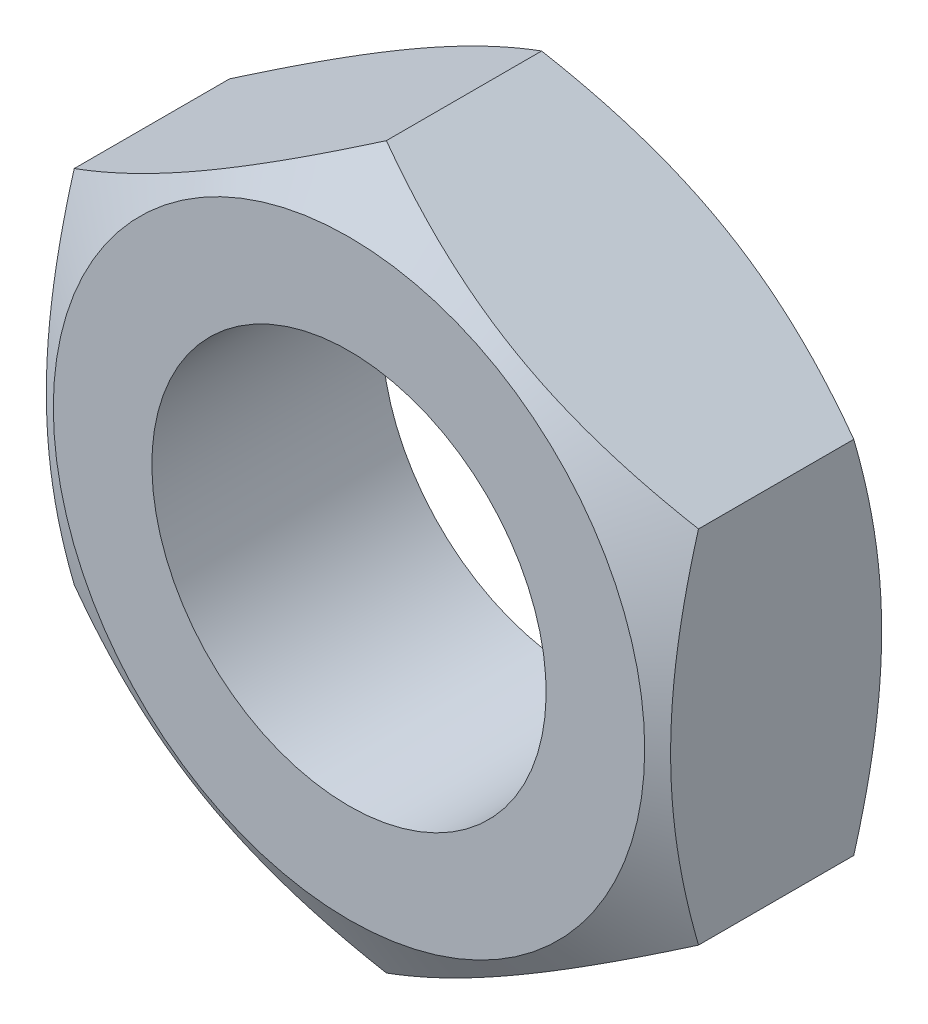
ISO-10303-21;
HEADER;
FILE_DESCRIPTION(('STEP AP214'),'2;1');
FILE_NAME('part.step','',(''),(''),'','','');
FILE_SCHEMA(('AUTOMOTIVE_DESIGN { 1 0 10303 214 1 1 1 1 }'));
ENDSEC;
DATA;
#1=APPLICATION_CONTEXT('core data for automotive mechanical design processes');
#2=APPLICATION_PROTOCOL_DEFINITION('international standard','automotive_design',2000,#1);
#3=PRODUCT_CONTEXT('',#1,'mechanical');
#4=PRODUCT('Part','Part','',(#3));
#5=PRODUCT_RELATED_PRODUCT_CATEGORY('part','',(#4));
#6=PRODUCT_DEFINITION_FORMATION('','',#4);
#7=PRODUCT_DEFINITION_CONTEXT('part definition',#1,'design');
#8=PRODUCT_DEFINITION('design','',#6,#7);
#9=PRODUCT_DEFINITION_SHAPE('','',#8);
#10=(LENGTH_UNIT() NAMED_UNIT(*) SI_UNIT(.MILLI.,.METRE.));
#11=(NAMED_UNIT(*) PLANE_ANGLE_UNIT() SI_UNIT($,.RADIAN.));
#12=(NAMED_UNIT(*) SI_UNIT($,.STERADIAN.) SOLID_ANGLE_UNIT());
#13=UNCERTAINTY_MEASURE_WITH_UNIT(LENGTH_MEASURE(1.E-05),#10,'distance_accuracy_value','');
#14=(GEOMETRIC_REPRESENTATION_CONTEXT(3) GLOBAL_UNCERTAINTY_ASSIGNED_CONTEXT((#13)) GLOBAL_UNIT_ASSIGNED_CONTEXT((#10,
#11,#12)) REPRESENTATION_CONTEXT('',''));
#15=CARTESIAN_POINT('',(0.,0.,0.));
#16=DIRECTION('',(0.,0.,1.));
#17=DIRECTION('',(1.,0.,0.));
#18=AXIS2_PLACEMENT_3D('',#15,#16,#17);
#19=CARTESIAN_POINT('',(-9.5,-5.48482755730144,10.));
#20=DIRECTION('',(-1.,0.,0.));
#21=DIRECTION('',(0.,0.,1.));
#22=AXIS2_PLACEMENT_3D('',#19,#20,#21);
#23=PLANE('',#22);
#24=CARTESIAN_POINT('',(-9.5,-14.8236051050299,2.03102792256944));
#25=CARTESIAN_POINT('',(-9.5,-14.6157605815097,2.13205783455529));
#26=CARTESIAN_POINT('',(-9.5,-14.4076745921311,2.23259076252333));
#27=CARTESIAN_POINT('',(-9.5,-13.9909693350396,2.43255026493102));
#28=CARTESIAN_POINT('',(-9.5,-13.7823500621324,2.53197682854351));
#29=CARTESIAN_POINT('',(-9.5,-13.1555624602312,2.82845402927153));
#30=CARTESIAN_POINT('',(-9.5,-12.7365244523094,3.02367288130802));
#31=CARTESIAN_POINT('',(-9.5,-11.8934370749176,3.40909408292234));
#32=CARTESIAN_POINT('',(-9.5,-11.4693728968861,3.5992641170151));
#33=CARTESIAN_POINT('',(-9.5,-10.6179039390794,3.97194486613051));
#34=CARTESIAN_POINT('',(-9.5,-10.1904993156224,4.15445593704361));
#35=CARTESIAN_POINT('',(-9.5,-9.31754199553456,4.51563983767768));
#36=CARTESIAN_POINT('',(-9.5,-8.87185469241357,4.6939890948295));
#37=CARTESIAN_POINT('',(-9.5,-7.97530061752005,5.03740807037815));
#38=CARTESIAN_POINT('',(-9.5,-7.52443327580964,5.20247631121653));
#39=CARTESIAN_POINT('',(-9.5,-6.61761118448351,5.51506563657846));
#40=CARTESIAN_POINT('',(-9.5,-6.16166854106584,5.66262146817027));
#41=CARTESIAN_POINT('',(-9.5,-5.24325954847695,5.93551302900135));
#42=CARTESIAN_POINT('',(-9.5,-4.78079527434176,6.06085566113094));
#43=CARTESIAN_POINT('',(-9.5,-3.85158182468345,6.28268820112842));
#44=CARTESIAN_POINT('',(-9.5,-3.38487173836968,6.37933746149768));
#45=CARTESIAN_POINT('',(-9.5,-2.68048494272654,6.49865231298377));
#46=CARTESIAN_POINT('',(-9.5,-2.44495249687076,6.53414900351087));
#47=CARTESIAN_POINT('',(-9.5,-1.97268628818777,6.59589537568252));
#48=CARTESIAN_POINT('',(-9.5,-1.73595264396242,6.62214595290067));
#49=CARTESIAN_POINT('',(-9.5,-1.26473411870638,6.66454302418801));
#50=CARTESIAN_POINT('',(-9.5,-1.0302608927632,6.68081853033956));
#51=CARTESIAN_POINT('',(-9.5,-0.560836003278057,6.70343487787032));
#52=CARTESIAN_POINT('',(-9.5,-0.32588434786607,6.7097758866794));
#53=CARTESIAN_POINT('',(-9.5,0.144076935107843,6.71237165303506));
#54=CARTESIAN_POINT('',(-9.5,0.379086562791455,6.70862638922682));
#55=CARTESIAN_POINT('',(-9.5,0.848736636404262,6.6911423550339));
#56=CARTESIAN_POINT('',(-9.5,1.08337706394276,6.67740310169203));
#57=CARTESIAN_POINT('',(-9.5,1.64454129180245,6.63288654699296));
#58=CARTESIAN_POINT('',(-9.5,1.97070898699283,6.59752022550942));
#59=CARTESIAN_POINT('',(-9.5,2.62066766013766,6.50938491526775));
#60=CARTESIAN_POINT('',(-9.5,2.9444583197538,6.45661363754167));
#61=CARTESIAN_POINT('',(-9.5,3.9118684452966,6.27498681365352));
#62=CARTESIAN_POINT('',(-9.5,4.5511772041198,6.12284965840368));
#63=CARTESIAN_POINT('',(-9.5,5.50727203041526,5.85845268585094));
#64=CARTESIAN_POINT('',(-9.5,5.82900138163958,5.76303539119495));
#65=CARTESIAN_POINT('',(-9.5,6.46933644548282,5.56214641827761));
#66=CARTESIAN_POINT('',(-9.5,6.7879421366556,5.45667467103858));
#67=CARTESIAN_POINT('',(-9.5,7.42212775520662,5.23738106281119));
#68=CARTESIAN_POINT('',(-9.5,7.73770860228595,5.1235618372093));
#69=CARTESIAN_POINT('',(-9.5,8.3662454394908,4.88892687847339));
#70=CARTESIAN_POINT('',(-9.5,8.67920146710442,4.76811124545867));
#71=CARTESIAN_POINT('',(-9.5,9.44360575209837,4.46475692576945));
#72=CARTESIAN_POINT('',(-9.5,9.89376872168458,4.27898465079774));
#73=CARTESIAN_POINT('',(-9.5,10.7900480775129,3.89789258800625));
#74=CARTESIAN_POINT('',(-9.5,11.2361641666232,3.70257210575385));
#75=CARTESIAN_POINT('',(-9.5,12.1251476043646,3.30438557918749));
#76=CARTESIAN_POINT('',(-9.5,12.5680140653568,3.10151755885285));
#77=CARTESIAN_POINT('',(-9.5,13.4509517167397,2.68983228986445));
#78=CARTESIAN_POINT('',(-9.5,13.8910229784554,2.48101519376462));
#79=CARTESIAN_POINT('',(-9.5,14.7693971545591,2.05833284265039));
#80=CARTESIAN_POINT('',(-9.5,15.2076972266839,1.8444616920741));
#81=CARTESIAN_POINT('',(-9.5,16.0823702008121,1.41281441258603));
#82=CARTESIAN_POINT('',(-9.5,16.5187430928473,1.19503826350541));
#83=CARTESIAN_POINT('',(-9.5,17.3898045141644,0.756309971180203));
#84=CARTESIAN_POINT('',(-9.5,17.8244932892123,0.535358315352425));
#85=CARTESIAN_POINT('',(-9.5,18.6925046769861,0.0907861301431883));
#86=CARTESIAN_POINT('',(-9.5,19.1258272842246,-0.132834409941));
#87=CARTESIAN_POINT('',(-9.5,20.3465823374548,-0.766800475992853));
#88=CARTESIAN_POINT('',(-9.5,21.1326754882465,-1.17972473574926));
#89=CARTESIAN_POINT('',(-9.5,22.7019966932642,-2.01104787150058));
#90=CARTESIAN_POINT('',(-9.5,23.4852246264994,-2.42944697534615));
#91=CARTESIAN_POINT('',(-9.5,25.0473018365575,-3.26925527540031));
#92=CARTESIAN_POINT('',(-9.5,25.8261572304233,-3.69065310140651));
#93=CARTESIAN_POINT('',(-9.5,26.9931018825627,-4.32515233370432));
#94=CARTESIAN_POINT('',(-9.5,27.3818487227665,-4.53704610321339));
#95=CARTESIAN_POINT('',(-9.5,28.1589485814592,-4.96155326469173));
#96=CARTESIAN_POINT('',(-9.5,28.5473016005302,-5.17416665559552));
#97=CARTESIAN_POINT('',(-9.5,28.9354805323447,-5.38709750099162));
#98=B_SPLINE_CURVE_WITH_KNOTS('',3,(#24,#25,#26,#27,#28,#29,#30,#31,#32,#33,#34,#35,#36,#37,#38,
#39,#40,#41,#42,#43,#44,#45,#46,#47,#48,#49,#50,#51,#52,#53,#54,#55,#56,#57,#58,#59,#60,#61,#62,
#63,#64,#65,#66,#67,#68,#69,#70,#71,#72,#73,#74,#75,#76,#77,#78,#79,#80,#81,#82,#83,#84,#85,#86,
#87,#88,#89,#90,#91,#92,#93,#94,#95,#96,#97),.UNSPECIFIED.,.F.,.F.,(4,2,2,2,2,2,2,2,2,2,2,2,2,2,
2,2,2,2,2,2,2,2,2,2,2,2,2,2,2,2,2,2,2,2,2,2,4),(0.,0.693293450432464,1.38659367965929,
2.7733947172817,4.16759357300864,5.56172757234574,7.00170593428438,8.44184427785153,
9.87907564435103,11.3158595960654,12.7445081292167,13.458932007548,14.173286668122,
14.8781957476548,15.5830929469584,16.2879916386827,16.9929243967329,17.9766088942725,
18.9604228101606,20.929096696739,21.9357517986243,22.9424138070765,23.9487593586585,
24.9550905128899,26.4159040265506,27.8768239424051,29.3381290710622,30.7993967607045,
32.2624625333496,33.7255358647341,35.1883869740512,36.6512439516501,39.3150503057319,
41.9789678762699,44.6355956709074,45.963829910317,47.2920621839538),.UNSPECIFIED.);
#99=CARTESIAN_POINT('',(-9.5,5.48482755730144,5.8628190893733));
#100=VERTEX_POINT('',#99);
#101=CARTESIAN_POINT('',(-9.5,-5.48482755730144,5.8628190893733));
#102=VERTEX_POINT('',#101);
#103=EDGE_CURVE('E74',#100,#102,#98,.F.);
#104=ORIENTED_EDGE('',*,*,#103,.F.);
#105=DIRECTION('',(0.,0.,-1.));
#106=VECTOR('',#105,1.);
#107=CARTESIAN_POINT('',(-9.5,5.48482755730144,10.));
#108=LINE('',#107,#106);
#109=CARTESIAN_POINT('',(-9.5,5.48482755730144,1.1371809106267));
#110=VERTEX_POINT('',#109);
#111=EDGE_CURVE('E43',#100,#110,#108,.T.);
#112=ORIENTED_EDGE('',*,*,#111,.T.);
#113=CARTESIAN_POINT('',(-9.5,-14.6687006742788,4.8937894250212));
#114=CARTESIAN_POINT('',(-9.5,-14.4615084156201,4.79338645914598));
#115=CARTESIAN_POINT('',(-9.5,-14.2540712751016,4.69348906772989));
#116=CARTESIAN_POINT('',(-9.5,-13.8386561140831,4.4948200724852));
#117=CARTESIAN_POINT('',(-9.5,-13.63067808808,4.39604848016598));
#118=CARTESIAN_POINT('',(-9.5,-13.0057997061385,4.10156789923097));
#119=CARTESIAN_POINT('',(-9.5,-12.5880173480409,3.90772338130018));
#120=CARTESIAN_POINT('',(-9.5,-11.7473306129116,3.52513337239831));
#121=CARTESIAN_POINT('',(-9.5,-11.3244106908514,3.33642195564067));
#122=CARTESIAN_POINT('',(-9.5,-10.4751851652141,2.96680533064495));
#123=CARTESIAN_POINT('',(-9.5,-10.0488797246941,2.78589974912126));
#124=CARTESIAN_POINT('',(-9.5,-9.17870639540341,2.42841765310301));
#125=CARTESIAN_POINT('',(-9.5,-8.73470813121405,2.25215673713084));
#126=CARTESIAN_POINT('',(-9.5,-7.84149462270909,1.91313091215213));
#127=CARTESIAN_POINT('',(-9.5,-7.39227879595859,1.75036752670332));
#128=CARTESIAN_POINT('',(-9.5,-6.48877170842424,1.44265749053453));
#129=CARTESIAN_POINT('',(-9.5,-6.03449305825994,1.29767421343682));
#130=CARTESIAN_POINT('',(-9.5,-5.11943656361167,1.03021677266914));
#131=CARTESIAN_POINT('',(-9.5,-4.65866083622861,0.90773545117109));
#132=CARTESIAN_POINT('',(-9.5,-3.73280971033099,0.69185651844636));
#133=CARTESIAN_POINT('',(-9.5,-3.26777143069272,0.598304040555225));
#134=CARTESIAN_POINT('',(-9.5,-2.56603115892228,0.483755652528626));
#135=CARTESIAN_POINT('',(-9.5,-2.33140289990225,0.449868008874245));
#136=CARTESIAN_POINT('',(-9.5,-1.86100211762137,0.391352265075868));
#137=CARTESIAN_POINT('',(-9.5,-1.62522970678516,0.366723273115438));
#138=CARTESIAN_POINT('',(-9.5,-1.15590855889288,0.32752110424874));
#139=CARTESIAN_POINT('',(-9.5,-0.922370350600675,0.3128223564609));
#140=CARTESIAN_POINT('',(-9.5,-0.454881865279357,0.293309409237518));
#141=CARTESIAN_POINT('',(-9.5,-0.220931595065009,0.288495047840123));
#142=CARTESIAN_POINT('',(-9.5,0.24696380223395,0.288865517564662));
#143=CARTESIAN_POINT('',(-9.5,0.480908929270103,0.294050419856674));
#144=CARTESIAN_POINT('',(-9.5,0.948374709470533,0.314293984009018));
#145=CARTESIAN_POINT('',(-9.5,1.1818953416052,0.329353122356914));
#146=CARTESIAN_POINT('',(-9.5,1.74506682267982,0.377260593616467));
#147=CARTESIAN_POINT('',(-9.5,2.07431695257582,0.414902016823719));
#148=CARTESIAN_POINT('',(-9.5,2.73033314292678,0.507748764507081));
#149=CARTESIAN_POINT('',(-9.5,3.05709885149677,0.562956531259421));
#150=CARTESIAN_POINT('',(-9.5,3.70784821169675,0.688971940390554));
#151=CARTESIAN_POINT('',(-9.5,4.0318294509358,0.759791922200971));
#152=CARTESIAN_POINT('',(-9.5,4.6765223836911,0.914874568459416));
#153=CARTESIAN_POINT('',(-9.5,4.99723413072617,0.999137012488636));
#154=CARTESIAN_POINT('',(-9.5,5.64242354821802,1.18104499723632));
#155=CARTESIAN_POINT('',(-9.5,5.9668293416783,1.27894371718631));
#156=CARTESIAN_POINT('',(-9.5,6.61244437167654,1.48471494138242));
#157=CARTESIAN_POINT('',(-9.5,6.93365358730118,1.59258751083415));
#158=CARTESIAN_POINT('',(-9.5,7.57303689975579,1.81660597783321));
#159=CARTESIAN_POINT('',(-9.5,7.89121199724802,1.93274903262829));
#160=CARTESIAN_POINT('',(-9.5,8.52493489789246,2.17195591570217));
#161=CARTESIAN_POINT('',(-9.5,8.84048273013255,2.29501966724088));
#162=CARTESIAN_POINT('',(-9.5,9.57839301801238,2.59064158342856));
#163=CARTESIAN_POINT('',(-9.5,9.99981165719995,2.76555194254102));
#164=CARTESIAN_POINT('',(-9.5,10.8391313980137,3.12364137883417));
#165=CARTESIAN_POINT('',(-9.5,11.2570322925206,3.30682093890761));
#166=CARTESIAN_POINT('',(-9.5,12.0899638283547,3.67981000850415));
#167=CARTESIAN_POINT('',(-9.5,12.5049938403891,3.86962091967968));
#168=CARTESIAN_POINT('',(-9.5,13.3325690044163,4.25455026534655));
#169=CARTESIAN_POINT('',(-9.5,13.7451142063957,4.44966859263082));
#170=CARTESIAN_POINT('',(-9.5,14.5685623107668,4.84443708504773));
#171=CARTESIAN_POINT('',(-9.5,14.9794630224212,5.0440918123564));
#172=CARTESIAN_POINT('',(-9.5,15.7995097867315,5.44697126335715));
#173=CARTESIAN_POINT('',(-9.5,16.2086558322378,5.65019600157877));
#174=CARTESIAN_POINT('',(-9.5,17.4337773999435,6.26423545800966));
#175=CARTESIAN_POINT('',(-9.5,18.2475397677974,6.67946539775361));
#176=CARTESIAN_POINT('',(-9.5,19.8038422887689,7.48365456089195));
#177=CARTESIAN_POINT('',(-9.5,20.5467231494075,7.87195733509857));
#178=CARTESIAN_POINT('',(-9.5,22.0297276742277,8.65384922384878));
#179=CARTESIAN_POINT('',(-9.5,22.7698512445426,9.047438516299));
#180=CARTESIAN_POINT('',(-9.5,24.2461609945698,9.8376962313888));
#181=CARTESIAN_POINT('',(-9.5,24.9823523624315,10.2343549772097));
#182=CARTESIAN_POINT('',(-9.5,26.4529685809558,11.0308418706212));
#183=CARTESIAN_POINT('',(-9.5,27.187393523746,11.4306698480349));
#184=CARTESIAN_POINT('',(-9.5,27.9211664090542,11.8316829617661));
#185=B_SPLINE_CURVE_WITH_KNOTS('',3,(#113,#114,#115,#116,#117,#118,#119,#120,#121,#122,#123,
#124,#125,#126,#127,#128,#129,#130,#131,#132,#133,#134,#135,#136,#137,#138,#139,#140,#141,#142,
#143,#144,#145,#146,#147,#148,#149,#150,#151,#152,#153,#154,#155,#156,#157,#158,#159,#160,#161,
#162,#163,#164,#165,#166,#167,#168,#169,#170,#171,#172,#173,#174,#175,#176,#177,#178,#179,#180,
#181,#182,#183,#184),.UNSPECIFIED.,.F.,.F.,(4,2,2,2,2,2,2,2,2,2,2,2,2,2,2,2,2,2,2,2,2,2,2,2,2,2,
2,2,2,2,2,2,2,2,2,4),(0.,0.690711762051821,1.38143057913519,2.76307600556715,4.15235213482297,
5.54156175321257,6.97450756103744,8.40761489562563,9.83771864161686,11.2673666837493,
12.6892232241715,13.4002577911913,14.1112238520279,14.8130222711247,15.5148091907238,
16.2166011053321,16.9184268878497,17.9120601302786,18.9058315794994,19.9003913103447,
20.8949347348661,21.911310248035,22.9276924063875,23.9437268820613,24.9597500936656,
26.3284573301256,27.6972445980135,29.0663229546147,30.4353736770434,31.8058681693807,
33.1763682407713,35.9170238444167,38.4317295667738,40.9465201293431,43.455265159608,
45.9638763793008),.UNSPECIFIED.);
#186=CARTESIAN_POINT('',(-9.5,-5.48482755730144,1.13718091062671));
#187=VERTEX_POINT('',#186);
#188=EDGE_CURVE('E92',#187,#110,#185,.T.);
#189=ORIENTED_EDGE('',*,*,#188,.F.);
#190=DIRECTION('',(0.,0.,-1.));
#191=VECTOR('',#190,1.);
#192=CARTESIAN_POINT('',(-9.5,-5.48482755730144,10.));
#193=LINE('',#192,#191);
#194=EDGE_CURVE('E29',#102,#187,#193,.T.);
#195=ORIENTED_EDGE('',*,*,#194,.F.);
#196=EDGE_LOOP('',(#104,#112,#189,#195));
#197=FACE_BOUND('',#196,.T.);
#198=ADVANCED_FACE('F14',(#197),#23,.T.);
#199=CARTESIAN_POINT('',(-9.5,-5.48482755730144,10.));
#200=DIRECTION('',(0.5,0.86602540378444,0.));
#201=DIRECTION('',(-0.86602540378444,0.5,0.));
#202=AXIS2_PLACEMENT_3D('',#199,#200,#201);
#203=PLANE('',#202);
#204=DIRECTION('',(0.,0.,-1.));
#205=VECTOR('',#204,1.);
#206=CARTESIAN_POINT('',(0.,-10.9696551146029,10.));
#207=LINE('',#206,#205);
#208=CARTESIAN_POINT('',(0.,-10.9696551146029,5.86281908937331));
#209=VERTEX_POINT('',#208);
#210=CARTESIAN_POINT('',(0.,-10.9696551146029,1.1371809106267));
#211=VERTEX_POINT('',#210);
#212=EDGE_CURVE('E99',#209,#211,#207,.T.);
#213=ORIENTED_EDGE('',*,*,#212,.F.);
#214=CARTESIAN_POINT('',(0.000200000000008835,-10.9697705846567,5.86275242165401));
#215=CARTESIAN_POINT('',(-0.208630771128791,-10.8492020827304,5.93235142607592));
#216=CARTESIAN_POINT('',(-0.4182401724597,-10.7281840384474,5.99879155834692));
#217=CARTESIAN_POINT('',(-0.839139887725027,-10.4851774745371,6.12447758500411));
#218=CARTESIAN_POINT('',(-1.05043073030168,-10.3631886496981,6.18372111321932));
#219=CARTESIAN_POINT('',(-1.68770779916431,-9.99525656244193,6.34951029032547));
#220=CARTESIAN_POINT('',(-2.11620976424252,-9.74786083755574,6.4438104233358));
#221=CARTESIAN_POINT('',(-2.75744333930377,-9.37764446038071,6.55438616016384));
#222=CARTESIAN_POINT('',(-2.96825921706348,-9.25592985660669,6.58588503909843));
#223=CARTESIAN_POINT('',(-3.39086703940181,-9.01193711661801,6.63870666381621));
#224=CARTESIAN_POINT('',(-3.60265900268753,-8.8896589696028,6.66002921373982));
#225=CARTESIAN_POINT('',(-4.02659621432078,-8.64489870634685,6.69195184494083));
#226=CARTESIAN_POINT('',(-4.23874074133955,-8.52241700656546,6.70256466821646));
#227=CARTESIAN_POINT('',(-4.66322575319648,-8.2773404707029,6.71284233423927));
#228=CARTESIAN_POINT('',(-4.87556623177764,-8.15474563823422,6.71250751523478));
#229=CARTESIAN_POINT('',(-5.27254199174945,-7.92555157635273,6.70165149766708));
#230=CARTESIAN_POINT('',(-5.45720529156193,-7.81893617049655,6.69245459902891));
#231=CARTESIAN_POINT('',(-5.82610000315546,-7.6059547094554,6.66595946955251));
#232=CARTESIAN_POINT('',(-6.01033138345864,-7.49958867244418,6.64866066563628));
#233=CARTESIAN_POINT('',(-6.562311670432,-7.18090270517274,6.58502038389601));
#234=CARTESIAN_POINT('',(-6.92908353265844,-6.96914687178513,6.52694296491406));
#235=CARTESIAN_POINT('',(-7.66651782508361,-6.5433889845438,6.38174885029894));
#236=CARTESIAN_POINT('',(-8.03708614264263,-6.32944126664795,6.29401669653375));
#237=CARTESIAN_POINT('',(-8.77269671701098,-5.90473630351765,6.09490112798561));
#238=CARTESIAN_POINT('',(-9.137748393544,-5.69397361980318,5.98356447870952));
#239=CARTESIAN_POINT('',(-9.5002,-5.4847120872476,5.86275242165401));
#240=B_SPLINE_CURVE_WITH_KNOTS('',3,(#214,#215,#216,#217,#218,#219,#220,#221,#222,#223,#224,
#225,#226,#227,#228,#229,#230,#231,#232,#233,#234,#235,#236,#237,#238,#239),.UNSPECIFIED.,.F.,
.F.,(4,2,2,2,2,2,2,2,2,2,2,2,4),(0.,0.752880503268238,1.50600787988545,3.0154687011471,
3.75167336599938,4.48789219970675,5.22323407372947,5.95855322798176,6.59868084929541,
7.23885375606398,8.52010929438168,9.82978009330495,11.1368800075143),.UNSPECIFIED.);
#241=EDGE_CURVE('E80',#209,#102,#240,.T.);
#242=ORIENTED_EDGE('',*,*,#241,.T.);
#243=ORIENTED_EDGE('',*,*,#194,.T.);
#244=CARTESIAN_POINT('',(-9.5002,-5.4847120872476,1.13724757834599));
#245=CARTESIAN_POINT('',(-9.2913692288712,-5.60528058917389,1.06764857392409));
#246=CARTESIAN_POINT('',(-9.08175982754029,-5.72629863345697,1.00120844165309));
#247=CARTESIAN_POINT('',(-8.66086011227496,-5.96930519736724,0.875522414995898));
#248=CARTESIAN_POINT('',(-8.44956926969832,-6.09129402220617,0.816278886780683));
#249=CARTESIAN_POINT('',(-7.81229220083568,-6.45922610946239,0.650489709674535));
#250=CARTESIAN_POINT('',(-7.38379023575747,-6.70662183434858,0.556189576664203));
#251=CARTESIAN_POINT('',(-6.74255666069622,-7.07683821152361,0.44561383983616));
#252=CARTESIAN_POINT('',(-6.53174078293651,-7.19855281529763,0.414114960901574));
#253=CARTESIAN_POINT('',(-6.10913296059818,-7.44254555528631,0.361293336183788));
#254=CARTESIAN_POINT('',(-5.89734099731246,-7.56482370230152,0.33997078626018));
#255=CARTESIAN_POINT('',(-5.4734037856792,-7.80958396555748,0.308048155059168));
#256=CARTESIAN_POINT('',(-5.26125925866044,-7.93206566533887,0.297435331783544));
#257=CARTESIAN_POINT('',(-4.83677424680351,-8.17714220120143,0.287157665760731));
#258=CARTESIAN_POINT('',(-4.62443376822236,-8.29973703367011,0.287492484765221));
#259=CARTESIAN_POINT('',(-4.22745800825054,-8.5289310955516,0.298348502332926));
#260=CARTESIAN_POINT('',(-4.04279470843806,-8.63554650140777,0.30754540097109));
#261=CARTESIAN_POINT('',(-3.67389999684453,-8.84852796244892,0.334040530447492));
#262=CARTESIAN_POINT('',(-3.48966861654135,-8.95489399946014,0.35133933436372));
#263=CARTESIAN_POINT('',(-2.93768832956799,-9.27357996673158,0.414979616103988));
#264=CARTESIAN_POINT('',(-2.57091646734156,-9.48533580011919,0.473057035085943));
#265=CARTESIAN_POINT('',(-1.83348217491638,-9.91109368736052,0.618251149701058));
#266=CARTESIAN_POINT('',(-1.46291385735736,-10.1250414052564,0.705983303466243));
#267=CARTESIAN_POINT('',(-0.727303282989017,-10.5497463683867,0.905098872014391));
#268=CARTESIAN_POINT('',(-0.362251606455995,-10.7605090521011,1.01643552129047));
#269=CARTESIAN_POINT('',(0.00020000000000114,-10.9697705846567,1.13724757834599));
#270=B_SPLINE_CURVE_WITH_KNOTS('',3,(#244,#245,#246,#247,#248,#249,#250,#251,#252,#253,#254,
#255,#256,#257,#258,#259,#260,#261,#262,#263,#264,#265,#266,#267,#268,#269),.UNSPECIFIED.,.F.,
.F.,(4,2,2,2,2,2,2,2,2,2,2,2,4),(0.,0.752880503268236,1.50600787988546,3.01546870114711,
3.75167336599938,4.48789219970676,5.22323407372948,5.95855322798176,6.59868084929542,
7.23885375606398,8.52010929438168,9.82978009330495,11.1368800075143),.UNSPECIFIED.);
#271=EDGE_CURVE('E166',#187,#211,#270,.T.);
#272=ORIENTED_EDGE('',*,*,#271,.T.);
#273=EDGE_LOOP('',(#213,#242,#243,#272));
#274=FACE_BOUND('',#273,.T.);
#275=ADVANCED_FACE('F16',(#274),#203,.F.);
#276=CARTESIAN_POINT('',(9.5,-5.48482755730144,10.));
#277=DIRECTION('',(0.5,-0.86602540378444,0.));
#278=DIRECTION('',(0.86602540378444,0.5,0.));
#279=AXIS2_PLACEMENT_3D('',#276,#277,#278);
#280=PLANE('',#279);
#281=CARTESIAN_POINT('',(-0.000199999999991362,-10.9697705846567,5.86275242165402));
#282=CARTESIAN_POINT('',(0.208630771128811,-10.8492020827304,5.93235142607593));
#283=CARTESIAN_POINT('',(0.41824017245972,-10.7281840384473,5.99879155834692));
#284=CARTESIAN_POINT('',(0.839139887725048,-10.4851774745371,6.12447758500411));
#285=CARTESIAN_POINT('',(1.0504307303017,-10.3631886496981,6.18372111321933));
#286=CARTESIAN_POINT('',(1.68770779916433,-9.99525656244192,6.34951029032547));
#287=CARTESIAN_POINT('',(2.11620976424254,-9.74786083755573,6.4438104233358));
#288=CARTESIAN_POINT('',(2.75744333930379,-9.3776444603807,6.55438616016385));
#289=CARTESIAN_POINT('',(2.9682592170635,-9.25592985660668,6.58588503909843));
#290=CARTESIAN_POINT('',(3.39086703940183,-9.011937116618,6.63870666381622));
#291=CARTESIAN_POINT('',(3.60265900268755,-8.88965896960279,6.66002921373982));
#292=CARTESIAN_POINT('',(4.0265962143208,-8.64489870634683,6.69195184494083));
#293=CARTESIAN_POINT('',(4.23874074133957,-8.52241700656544,6.70256466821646));
#294=CARTESIAN_POINT('',(4.6632257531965,-8.27734047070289,6.71284233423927));
#295=CARTESIAN_POINT('',(4.87556623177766,-8.15474563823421,6.71250751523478));
#296=CARTESIAN_POINT('',(5.27254199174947,-7.92555157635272,6.70165149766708));
#297=CARTESIAN_POINT('',(5.45720529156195,-7.81893617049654,6.69245459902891));
#298=CARTESIAN_POINT('',(5.82610000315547,-7.60595470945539,6.66595946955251));
#299=CARTESIAN_POINT('',(6.01033138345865,-7.49958867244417,6.64866066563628));
#300=CARTESIAN_POINT('',(6.56231167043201,-7.18090270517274,6.58502038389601));
#301=CARTESIAN_POINT('',(6.92908353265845,-6.96914687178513,6.52694296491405));
#302=CARTESIAN_POINT('',(7.66651782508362,-6.54338898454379,6.38174885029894));
#303=CARTESIAN_POINT('',(8.03708614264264,-6.32944126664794,6.29401669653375));
#304=CARTESIAN_POINT('',(8.77269671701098,-5.90473630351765,6.0949011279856));
#305=CARTESIAN_POINT('',(9.13774839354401,-5.69397361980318,5.98356447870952));
#306=CARTESIAN_POINT('',(9.5002,-5.4847120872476,5.86275242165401));
#307=B_SPLINE_CURVE_WITH_KNOTS('',3,(#281,#282,#283,#284,#285,#286,#287,#288,#289,#290,#291,
#292,#293,#294,#295,#296,#297,#298,#299,#300,#301,#302,#303,#304,#305,#306),.UNSPECIFIED.,.F.,
.F.,(4,2,2,2,2,2,2,2,2,2,2,2,4),(0.,0.752880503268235,1.50600787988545,3.0154687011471,
3.75167336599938,4.48789219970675,5.22323407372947,5.95855322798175,6.59868084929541,
7.23885375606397,8.52010929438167,9.82978009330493,11.1368800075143),.UNSPECIFIED.);
#308=CARTESIAN_POINT('',(9.5,-5.48482755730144,5.8628190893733));
#309=VERTEX_POINT('',#308);
#310=EDGE_CURVE('E138',#209,#309,#307,.T.);
#311=ORIENTED_EDGE('',*,*,#310,.F.);
#312=ORIENTED_EDGE('',*,*,#212,.T.);
#313=CARTESIAN_POINT('',(9.5002,-5.4847120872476,1.13724757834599));
#314=CARTESIAN_POINT('',(9.2913692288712,-5.60528058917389,1.06764857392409));
#315=CARTESIAN_POINT('',(9.08175982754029,-5.72629863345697,1.00120844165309));
#316=CARTESIAN_POINT('',(8.66086011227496,-5.96930519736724,0.875522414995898));
#317=CARTESIAN_POINT('',(8.44956926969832,-6.09129402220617,0.816278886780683));
#318=CARTESIAN_POINT('',(7.81229220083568,-6.45922610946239,0.650489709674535));
#319=CARTESIAN_POINT('',(7.38379023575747,-6.70662183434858,0.556189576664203));
#320=CARTESIAN_POINT('',(6.74255666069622,-7.07683821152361,0.44561383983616));
#321=CARTESIAN_POINT('',(6.53174078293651,-7.19855281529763,0.414114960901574));
#322=CARTESIAN_POINT('',(6.10913296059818,-7.44254555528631,0.361293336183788));
#323=CARTESIAN_POINT('',(5.89734099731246,-7.56482370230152,0.33997078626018));
#324=CARTESIAN_POINT('',(5.4734037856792,-7.80958396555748,0.308048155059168));
#325=CARTESIAN_POINT('',(5.26125925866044,-7.93206566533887,0.297435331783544));
#326=CARTESIAN_POINT('',(4.83677424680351,-8.17714220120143,0.287157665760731));
#327=CARTESIAN_POINT('',(4.62443376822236,-8.29973703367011,0.287492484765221));
#328=CARTESIAN_POINT('',(4.22745800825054,-8.5289310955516,0.298348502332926));
#329=CARTESIAN_POINT('',(4.04279470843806,-8.63554650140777,0.30754540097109));
#330=CARTESIAN_POINT('',(3.67389999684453,-8.84852796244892,0.334040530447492));
#331=CARTESIAN_POINT('',(3.48966861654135,-8.95489399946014,0.35133933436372));
#332=CARTESIAN_POINT('',(2.93768832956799,-9.27357996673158,0.414979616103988));
#333=CARTESIAN_POINT('',(2.57091646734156,-9.48533580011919,0.473057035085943));
#334=CARTESIAN_POINT('',(1.83348217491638,-9.91109368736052,0.618251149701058));
#335=CARTESIAN_POINT('',(1.46291385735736,-10.1250414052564,0.705983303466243));
#336=CARTESIAN_POINT('',(0.727303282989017,-10.5497463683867,0.905098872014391));
#337=CARTESIAN_POINT('',(0.362251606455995,-10.7605090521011,1.01643552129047));
#338=CARTESIAN_POINT('',(-0.00020000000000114,-10.9697705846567,1.13724757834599));
#339=B_SPLINE_CURVE_WITH_KNOTS('',3,(#313,#314,#315,#316,#317,#318,#319,#320,#321,#322,#323,
#324,#325,#326,#327,#328,#329,#330,#331,#332,#333,#334,#335,#336,#337,#338),.UNSPECIFIED.,.F.,
.F.,(4,2,2,2,2,2,2,2,2,2,2,2,4),(0.,0.752880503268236,1.50600787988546,3.01546870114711,
3.75167336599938,4.48789219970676,5.22323407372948,5.95855322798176,6.59868084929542,
7.23885375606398,8.52010929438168,9.82978009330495,11.1368800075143),.UNSPECIFIED.);
#340=CARTESIAN_POINT('',(9.5,-5.48482755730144,1.13718091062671));
#341=VERTEX_POINT('',#340);
#342=EDGE_CURVE('E173',#341,#211,#339,.T.);
#343=ORIENTED_EDGE('',*,*,#342,.F.);
#344=DIRECTION('',(0.,0.,-1.));
#345=VECTOR('',#344,1.);
#346=CARTESIAN_POINT('',(9.5,-5.48482755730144,10.));
#347=LINE('',#346,#345);
#348=EDGE_CURVE('E97',#309,#341,#347,.T.);
#349=ORIENTED_EDGE('',*,*,#348,.F.);
#350=EDGE_LOOP('',(#311,#312,#343,#349));
#351=FACE_BOUND('',#350,.T.);
#352=ADVANCED_FACE('F186',(#351),#280,.T.);
#353=CARTESIAN_POINT('',(9.5,-5.48482755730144,10.));
#354=DIRECTION('',(-1.,0.,0.));
#355=DIRECTION('',(0.,0.,1.));
#356=AXIS2_PLACEMENT_3D('',#353,#354,#355);
#357=PLANE('',#356);
#358=DIRECTION('',(0.,0.,-1.));
#359=VECTOR('',#358,1.);
#360=CARTESIAN_POINT('',(9.5,5.48482755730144,10.));
#361=LINE('',#360,#359);
#362=CARTESIAN_POINT('',(9.5,5.48482755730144,5.8628190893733));
#363=VERTEX_POINT('',#362);
#364=CARTESIAN_POINT('',(9.5,5.48482755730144,1.13718091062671));
#365=VERTEX_POINT('',#364);
#366=EDGE_CURVE('E89',#363,#365,#361,.T.);
#367=ORIENTED_EDGE('',*,*,#366,.F.);
#368=CARTESIAN_POINT('',(9.5,-14.8236051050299,2.03102792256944));
#369=CARTESIAN_POINT('',(9.5,-14.6157605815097,2.13205783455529));
#370=CARTESIAN_POINT('',(9.5,-14.4076745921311,2.23259076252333));
#371=CARTESIAN_POINT('',(9.5,-13.9909693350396,2.43255026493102));
#372=CARTESIAN_POINT('',(9.5,-13.7823500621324,2.53197682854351));
#373=CARTESIAN_POINT('',(9.5,-13.1555624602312,2.82845402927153));
#374=CARTESIAN_POINT('',(9.5,-12.7365244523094,3.02367288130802));
#375=CARTESIAN_POINT('',(9.5,-11.8934370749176,3.40909408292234));
#376=CARTESIAN_POINT('',(9.5,-11.4693728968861,3.5992641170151));
#377=CARTESIAN_POINT('',(9.5,-10.6179039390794,3.97194486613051));
#378=CARTESIAN_POINT('',(9.5,-10.1904993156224,4.15445593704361));
#379=CARTESIAN_POINT('',(9.5,-9.31754199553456,4.51563983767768));
#380=CARTESIAN_POINT('',(9.5,-8.87185469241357,4.6939890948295));
#381=CARTESIAN_POINT('',(9.5,-7.97530061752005,5.03740807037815));
#382=CARTESIAN_POINT('',(9.5,-7.52443327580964,5.20247631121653));
#383=CARTESIAN_POINT('',(9.5,-6.61761118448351,5.51506563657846));
#384=CARTESIAN_POINT('',(9.5,-6.16166854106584,5.66262146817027));
#385=CARTESIAN_POINT('',(9.5,-5.24325954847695,5.93551302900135));
#386=CARTESIAN_POINT('',(9.5,-4.78079527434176,6.06085566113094));
#387=CARTESIAN_POINT('',(9.5,-3.85158182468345,6.28268820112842));
#388=CARTESIAN_POINT('',(9.5,-3.38487173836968,6.37933746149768));
#389=CARTESIAN_POINT('',(9.5,-2.68048494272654,6.49865231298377));
#390=CARTESIAN_POINT('',(9.5,-2.44495249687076,6.53414900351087));
#391=CARTESIAN_POINT('',(9.5,-1.97268628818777,6.59589537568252));
#392=CARTESIAN_POINT('',(9.5,-1.73595264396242,6.62214595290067));
#393=CARTESIAN_POINT('',(9.5,-1.26473411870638,6.66454302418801));
#394=CARTESIAN_POINT('',(9.5,-1.0302608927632,6.68081853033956));
#395=CARTESIAN_POINT('',(9.5,-0.560836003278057,6.70343487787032));
#396=CARTESIAN_POINT('',(9.5,-0.32588434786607,6.7097758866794));
#397=CARTESIAN_POINT('',(9.5,0.144076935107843,6.71237165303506));
#398=CARTESIAN_POINT('',(9.5,0.379086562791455,6.70862638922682));
#399=CARTESIAN_POINT('',(9.5,0.848736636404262,6.6911423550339));
#400=CARTESIAN_POINT('',(9.5,1.08337706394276,6.67740310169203));
#401=CARTESIAN_POINT('',(9.5,1.64454129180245,6.63288654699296));
#402=CARTESIAN_POINT('',(9.5,1.97070898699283,6.59752022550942));
#403=CARTESIAN_POINT('',(9.5,2.62066766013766,6.50938491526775));
#404=CARTESIAN_POINT('',(9.5,2.9444583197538,6.45661363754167));
#405=CARTESIAN_POINT('',(9.5,3.9118684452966,6.27498681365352));
#406=CARTESIAN_POINT('',(9.5,4.5511772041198,6.12284965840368));
#407=CARTESIAN_POINT('',(9.5,5.50727203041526,5.85845268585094));
#408=CARTESIAN_POINT('',(9.5,5.82900138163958,5.76303539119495));
#409=CARTESIAN_POINT('',(9.5,6.46933644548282,5.56214641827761));
#410=CARTESIAN_POINT('',(9.5,6.7879421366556,5.45667467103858));
#411=CARTESIAN_POINT('',(9.5,7.42212775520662,5.23738106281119));
#412=CARTESIAN_POINT('',(9.5,7.73770860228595,5.1235618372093));
#413=CARTESIAN_POINT('',(9.5,8.3662454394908,4.88892687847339));
#414=CARTESIAN_POINT('',(9.5,8.67920146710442,4.76811124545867));
#415=CARTESIAN_POINT('',(9.5,9.44360575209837,4.46475692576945));
#416=CARTESIAN_POINT('',(9.5,9.89376872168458,4.27898465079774));
#417=CARTESIAN_POINT('',(9.5,10.7900480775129,3.89789258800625));
#418=CARTESIAN_POINT('',(9.5,11.2361641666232,3.70257210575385));
#419=CARTESIAN_POINT('',(9.5,12.1251476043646,3.30438557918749));
#420=CARTESIAN_POINT('',(9.5,12.5680140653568,3.10151755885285));
#421=CARTESIAN_POINT('',(9.5,13.4509517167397,2.68983228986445));
#422=CARTESIAN_POINT('',(9.5,13.8910229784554,2.48101519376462));
#423=CARTESIAN_POINT('',(9.5,14.7693971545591,2.05833284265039));
#424=CARTESIAN_POINT('',(9.5,15.2076972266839,1.8444616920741));
#425=CARTESIAN_POINT('',(9.5,16.0823702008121,1.41281441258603));
#426=CARTESIAN_POINT('',(9.5,16.5187430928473,1.19503826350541));
#427=CARTESIAN_POINT('',(9.5,17.3898045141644,0.756309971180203));
#428=CARTESIAN_POINT('',(9.5,17.8244932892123,0.535358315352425));
#429=CARTESIAN_POINT('',(9.5,18.6925046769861,0.0907861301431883));
#430=CARTESIAN_POINT('',(9.5,19.1258272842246,-0.132834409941));
#431=CARTESIAN_POINT('',(9.5,20.3465823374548,-0.766800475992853));
#432=CARTESIAN_POINT('',(9.5,21.1326754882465,-1.17972473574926));
#433=CARTESIAN_POINT('',(9.5,22.7019966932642,-2.01104787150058));
#434=CARTESIAN_POINT('',(9.5,23.4852246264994,-2.42944697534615));
#435=CARTESIAN_POINT('',(9.5,25.0473018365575,-3.26925527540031));
#436=CARTESIAN_POINT('',(9.5,25.8261572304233,-3.69065310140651));
#437=CARTESIAN_POINT('',(9.5,26.9931018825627,-4.32515233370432));
#438=CARTESIAN_POINT('',(9.5,27.3818487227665,-4.53704610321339));
#439=CARTESIAN_POINT('',(9.5,28.1589485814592,-4.96155326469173));
#440=CARTESIAN_POINT('',(9.5,28.5473016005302,-5.17416665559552));
#441=CARTESIAN_POINT('',(9.5,28.9354805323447,-5.38709750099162));
#442=B_SPLINE_CURVE_WITH_KNOTS('',3,(#368,#369,#370,#371,#372,#373,#374,#375,#376,#377,#378,
#379,#380,#381,#382,#383,#384,#385,#386,#387,#388,#389,#390,#391,#392,#393,#394,#395,#396,#397,
#398,#399,#400,#401,#402,#403,#404,#405,#406,#407,#408,#409,#410,#411,#412,#413,#414,#415,#416,
#417,#418,#419,#420,#421,#422,#423,#424,#425,#426,#427,#428,#429,#430,#431,#432,#433,#434,#435,
#436,#437,#438,#439,#440,#441),.UNSPECIFIED.,.F.,.F.,(4,2,2,2,2,2,2,2,2,2,2,2,2,2,2,2,2,2,2,2,2,
2,2,2,2,2,2,2,2,2,2,2,2,2,2,2,4),(0.,0.693293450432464,1.38659367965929,2.7733947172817,
4.16759357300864,5.56172757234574,7.00170593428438,8.44184427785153,9.87907564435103,
11.3158595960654,12.7445081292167,13.458932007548,14.173286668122,14.8781957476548,
15.5830929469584,16.2879916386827,16.9929243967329,17.9766088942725,18.9604228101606,
20.929096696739,21.9357517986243,22.9424138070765,23.9487593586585,24.9550905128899,
26.4159040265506,27.8768239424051,29.3381290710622,30.7993967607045,32.2624625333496,
33.7255358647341,35.1883869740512,36.6512439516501,39.3150503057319,41.9789678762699,
44.6355956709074,45.963829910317,47.2920621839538),.UNSPECIFIED.);
#443=EDGE_CURVE('E106',#363,#309,#442,.F.);
#444=ORIENTED_EDGE('',*,*,#443,.T.);
#445=ORIENTED_EDGE('',*,*,#348,.T.);
#446=CARTESIAN_POINT('',(9.5,-14.6687006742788,4.8937894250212));
#447=CARTESIAN_POINT('',(9.5,-14.4615084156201,4.79338645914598));
#448=CARTESIAN_POINT('',(9.5,-14.2540712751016,4.69348906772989));
#449=CARTESIAN_POINT('',(9.5,-13.8386561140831,4.4948200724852));
#450=CARTESIAN_POINT('',(9.5,-13.63067808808,4.39604848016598));
#451=CARTESIAN_POINT('',(9.5,-13.0057997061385,4.10156789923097));
#452=CARTESIAN_POINT('',(9.5,-12.5880173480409,3.90772338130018));
#453=CARTESIAN_POINT('',(9.5,-11.7473306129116,3.52513337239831));
#454=CARTESIAN_POINT('',(9.5,-11.3244106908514,3.33642195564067));
#455=CARTESIAN_POINT('',(9.5,-10.4751851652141,2.96680533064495));
#456=CARTESIAN_POINT('',(9.5,-10.0488797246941,2.78589974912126));
#457=CARTESIAN_POINT('',(9.5,-9.17870639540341,2.42841765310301));
#458=CARTESIAN_POINT('',(9.5,-8.73470813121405,2.25215673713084));
#459=CARTESIAN_POINT('',(9.5,-7.84149462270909,1.91313091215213));
#460=CARTESIAN_POINT('',(9.5,-7.39227879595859,1.75036752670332));
#461=CARTESIAN_POINT('',(9.5,-6.48877170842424,1.44265749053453));
#462=CARTESIAN_POINT('',(9.5,-6.03449305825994,1.29767421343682));
#463=CARTESIAN_POINT('',(9.5,-5.11943656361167,1.03021677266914));
#464=CARTESIAN_POINT('',(9.5,-4.65866083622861,0.90773545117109));
#465=CARTESIAN_POINT('',(9.5,-3.73280971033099,0.69185651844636));
#466=CARTESIAN_POINT('',(9.5,-3.26777143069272,0.598304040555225));
#467=CARTESIAN_POINT('',(9.5,-2.56603115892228,0.483755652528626));
#468=CARTESIAN_POINT('',(9.5,-2.33140289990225,0.449868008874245));
#469=CARTESIAN_POINT('',(9.5,-1.86100211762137,0.391352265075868));
#470=CARTESIAN_POINT('',(9.5,-1.62522970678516,0.366723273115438));
#471=CARTESIAN_POINT('',(9.5,-1.15590855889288,0.32752110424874));
#472=CARTESIAN_POINT('',(9.5,-0.922370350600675,0.3128223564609));
#473=CARTESIAN_POINT('',(9.5,-0.454881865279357,0.293309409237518));
#474=CARTESIAN_POINT('',(9.5,-0.220931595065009,0.288495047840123));
#475=CARTESIAN_POINT('',(9.5,0.24696380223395,0.288865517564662));
#476=CARTESIAN_POINT('',(9.5,0.480908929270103,0.294050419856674));
#477=CARTESIAN_POINT('',(9.5,0.948374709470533,0.314293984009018));
#478=CARTESIAN_POINT('',(9.5,1.1818953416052,0.329353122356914));
#479=CARTESIAN_POINT('',(9.5,1.74506682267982,0.377260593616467));
#480=CARTESIAN_POINT('',(9.5,2.07431695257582,0.414902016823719));
#481=CARTESIAN_POINT('',(9.5,2.73033314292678,0.507748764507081));
#482=CARTESIAN_POINT('',(9.5,3.05709885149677,0.562956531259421));
#483=CARTESIAN_POINT('',(9.5,3.70784821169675,0.688971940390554));
#484=CARTESIAN_POINT('',(9.5,4.0318294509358,0.759791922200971));
#485=CARTESIAN_POINT('',(9.5,4.6765223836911,0.914874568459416));
#486=CARTESIAN_POINT('',(9.5,4.99723413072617,0.999137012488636));
#487=CARTESIAN_POINT('',(9.5,5.64242354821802,1.18104499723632));
#488=CARTESIAN_POINT('',(9.5,5.9668293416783,1.27894371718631));
#489=CARTESIAN_POINT('',(9.5,6.61244437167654,1.48471494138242));
#490=CARTESIAN_POINT('',(9.5,6.93365358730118,1.59258751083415));
#491=CARTESIAN_POINT('',(9.5,7.57303689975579,1.81660597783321));
#492=CARTESIAN_POINT('',(9.5,7.89121199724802,1.93274903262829));
#493=CARTESIAN_POINT('',(9.5,8.52493489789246,2.17195591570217));
#494=CARTESIAN_POINT('',(9.5,8.84048273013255,2.29501966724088));
#495=CARTESIAN_POINT('',(9.5,9.57839301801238,2.59064158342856));
#496=CARTESIAN_POINT('',(9.5,9.99981165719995,2.76555194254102));
#497=CARTESIAN_POINT('',(9.5,10.8391313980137,3.12364137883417));
#498=CARTESIAN_POINT('',(9.5,11.2570322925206,3.30682093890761));
#499=CARTESIAN_POINT('',(9.5,12.0899638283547,3.67981000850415));
#500=CARTESIAN_POINT('',(9.5,12.5049938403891,3.86962091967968));
#501=CARTESIAN_POINT('',(9.5,13.3325690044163,4.25455026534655));
#502=CARTESIAN_POINT('',(9.5,13.7451142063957,4.44966859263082));
#503=CARTESIAN_POINT('',(9.5,14.5685623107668,4.84443708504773));
#504=CARTESIAN_POINT('',(9.5,14.9794630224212,5.0440918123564));
#505=CARTESIAN_POINT('',(9.5,15.7995097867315,5.44697126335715));
#506=CARTESIAN_POINT('',(9.5,16.2086558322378,5.65019600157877));
#507=CARTESIAN_POINT('',(9.5,17.4337773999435,6.26423545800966));
#508=CARTESIAN_POINT('',(9.5,18.2475397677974,6.67946539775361));
#509=CARTESIAN_POINT('',(9.5,19.8038422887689,7.48365456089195));
#510=CARTESIAN_POINT('',(9.5,20.5467231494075,7.87195733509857));
#511=CARTESIAN_POINT('',(9.5,22.0297276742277,8.65384922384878));
#512=CARTESIAN_POINT('',(9.5,22.7698512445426,9.047438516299));
#513=CARTESIAN_POINT('',(9.5,24.2461609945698,9.8376962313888));
#514=CARTESIAN_POINT('',(9.5,24.9823523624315,10.2343549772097));
#515=CARTESIAN_POINT('',(9.5,26.4529685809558,11.0308418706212));
#516=CARTESIAN_POINT('',(9.5,27.187393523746,11.4306698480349));
#517=CARTESIAN_POINT('',(9.5,27.9211664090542,11.8316829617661));
#518=B_SPLINE_CURVE_WITH_KNOTS('',3,(#446,#447,#448,#449,#450,#451,#452,#453,#454,#455,#456,
#457,#458,#459,#460,#461,#462,#463,#464,#465,#466,#467,#468,#469,#470,#471,#472,#473,#474,#475,
#476,#477,#478,#479,#480,#481,#482,#483,#484,#485,#486,#487,#488,#489,#490,#491,#492,#493,#494,
#495,#496,#497,#498,#499,#500,#501,#502,#503,#504,#505,#506,#507,#508,#509,#510,#511,#512,#513,
#514,#515,#516,#517),.UNSPECIFIED.,.F.,.F.,(4,2,2,2,2,2,2,2,2,2,2,2,2,2,2,2,2,2,2,2,2,2,2,2,2,2,
2,2,2,2,2,2,2,2,2,4),(0.,0.690711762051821,1.38143057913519,2.76307600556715,4.15235213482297,
5.54156175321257,6.97450756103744,8.40761489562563,9.83771864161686,11.2673666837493,
12.6892232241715,13.4002577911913,14.1112238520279,14.8130222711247,15.5148091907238,
16.2166011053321,16.9184268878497,17.9120601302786,18.9058315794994,19.9003913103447,
20.8949347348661,21.911310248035,22.9276924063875,23.9437268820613,24.9597500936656,
26.3284573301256,27.6972445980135,29.0663229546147,30.4353736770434,31.8058681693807,
33.1763682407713,35.9170238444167,38.4317295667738,40.9465201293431,43.455265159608,
45.9638763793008),.UNSPECIFIED.);
#519=EDGE_CURVE('E180',#341,#365,#518,.T.);
#520=ORIENTED_EDGE('',*,*,#519,.T.);
#521=EDGE_LOOP('',(#367,#444,#445,#520));
#522=FACE_BOUND('',#521,.T.);
#523=ADVANCED_FACE('F189',(#522),#357,.F.);
#524=CARTESIAN_POINT('',(9.5,5.48482755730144,10.));
#525=DIRECTION('',(-0.5,-0.86602540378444,0.));
#526=DIRECTION('',(0.86602540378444,-0.5,0.));
#527=AXIS2_PLACEMENT_3D('',#524,#525,#526);
#528=PLANE('',#527);
#529=DIRECTION('',(0.,0.,-1.));
#530=VECTOR('',#529,1.);
#531=CARTESIAN_POINT('',(0.,10.9696551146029,10.));
#532=LINE('',#531,#530);
#533=CARTESIAN_POINT('',(0.,10.9696551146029,5.86281908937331));
#534=VERTEX_POINT('',#533);
#535=CARTESIAN_POINT('',(0.,10.9696551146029,1.1371809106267));
#536=VERTEX_POINT('',#535);
#537=EDGE_CURVE('E86',#534,#536,#532,.T.);
#538=ORIENTED_EDGE('',*,*,#537,.F.);
#539=CARTESIAN_POINT('',(-0.000200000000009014,10.9697705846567,5.86275242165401));
#540=CARTESIAN_POINT('',(0.20863077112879,10.8492020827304,5.93235142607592));
#541=CARTESIAN_POINT('',(0.418240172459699,10.7281840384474,5.99879155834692));
#542=CARTESIAN_POINT('',(0.839139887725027,10.4851774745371,6.12447758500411));
#543=CARTESIAN_POINT('',(1.05043073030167,10.3631886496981,6.18372111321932));
#544=CARTESIAN_POINT('',(1.68770779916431,9.99525656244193,6.34951029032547));
#545=CARTESIAN_POINT('',(2.11620976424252,9.74786083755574,6.4438104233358));
#546=CARTESIAN_POINT('',(2.75744333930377,9.37764446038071,6.55438616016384));
#547=CARTESIAN_POINT('',(2.96825921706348,9.25592985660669,6.58588503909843));
#548=CARTESIAN_POINT('',(3.39086703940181,9.01193711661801,6.63870666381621));
#549=CARTESIAN_POINT('',(3.60265900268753,8.8896589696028,6.66002921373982));
#550=CARTESIAN_POINT('',(4.02659621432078,8.64489870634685,6.69195184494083));
#551=CARTESIAN_POINT('',(4.23874074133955,8.52241700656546,6.70256466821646));
#552=CARTESIAN_POINT('',(4.66322575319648,8.2773404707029,6.71284233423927));
#553=CARTESIAN_POINT('',(4.87556623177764,8.15474563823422,6.71250751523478));
#554=CARTESIAN_POINT('',(5.27254199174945,7.92555157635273,6.70165149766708));
#555=CARTESIAN_POINT('',(5.45720529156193,7.81893617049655,6.69245459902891));
#556=CARTESIAN_POINT('',(5.82610000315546,7.6059547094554,6.66595946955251));
#557=CARTESIAN_POINT('',(6.01033138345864,7.49958867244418,6.64866066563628));
#558=CARTESIAN_POINT('',(6.562311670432,7.18090270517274,6.58502038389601));
#559=CARTESIAN_POINT('',(6.92908353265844,6.96914687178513,6.52694296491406));
#560=CARTESIAN_POINT('',(7.66651782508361,6.5433889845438,6.38174885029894));
#561=CARTESIAN_POINT('',(8.03708614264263,6.32944126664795,6.29401669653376));
#562=CARTESIAN_POINT('',(8.77269671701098,5.90473630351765,6.09490112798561));
#563=CARTESIAN_POINT('',(9.137748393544,5.69397361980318,5.98356447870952));
#564=CARTESIAN_POINT('',(9.5002,5.4847120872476,5.86275242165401));
#565=B_SPLINE_CURVE_WITH_KNOTS('',3,(#539,#540,#541,#542,#543,#544,#545,#546,#547,#548,#549,
#550,#551,#552,#553,#554,#555,#556,#557,#558,#559,#560,#561,#562,#563,#564),.UNSPECIFIED.,.F.,
.F.,(4,2,2,2,2,2,2,2,2,2,2,2,4),(0.,0.752880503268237,1.50600787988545,3.0154687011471,
3.75167336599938,4.48789219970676,5.22323407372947,5.95855322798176,6.59868084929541,
7.23885375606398,8.52010929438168,9.82978009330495,11.1368800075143),.UNSPECIFIED.);
#566=EDGE_CURVE('E35',#534,#363,#565,.T.);
#567=ORIENTED_EDGE('',*,*,#566,.T.);
#568=ORIENTED_EDGE('',*,*,#366,.T.);
#569=CARTESIAN_POINT('',(9.5002,5.4847120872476,1.13724757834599));
#570=CARTESIAN_POINT('',(9.2913692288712,5.60528058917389,1.06764857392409));
#571=CARTESIAN_POINT('',(9.08175982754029,5.72629863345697,1.00120844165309));
#572=CARTESIAN_POINT('',(8.66086011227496,5.96930519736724,0.875522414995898));
#573=CARTESIAN_POINT('',(8.44956926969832,6.09129402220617,0.816278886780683));
#574=CARTESIAN_POINT('',(7.81229220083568,6.45922610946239,0.650489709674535));
#575=CARTESIAN_POINT('',(7.38379023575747,6.70662183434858,0.556189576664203));
#576=CARTESIAN_POINT('',(6.74255666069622,7.07683821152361,0.44561383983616));
#577=CARTESIAN_POINT('',(6.53174078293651,7.19855281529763,0.414114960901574));
#578=CARTESIAN_POINT('',(6.10913296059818,7.44254555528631,0.361293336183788));
#579=CARTESIAN_POINT('',(5.89734099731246,7.56482370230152,0.33997078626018));
#580=CARTESIAN_POINT('',(5.4734037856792,7.80958396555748,0.308048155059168));
#581=CARTESIAN_POINT('',(5.26125925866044,7.93206566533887,0.297435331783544));
#582=CARTESIAN_POINT('',(4.83677424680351,8.17714220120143,0.287157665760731));
#583=CARTESIAN_POINT('',(4.62443376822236,8.29973703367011,0.287492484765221));
#584=CARTESIAN_POINT('',(4.22745800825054,8.5289310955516,0.298348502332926));
#585=CARTESIAN_POINT('',(4.04279470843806,8.63554650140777,0.30754540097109));
#586=CARTESIAN_POINT('',(3.67389999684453,8.84852796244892,0.334040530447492));
#587=CARTESIAN_POINT('',(3.48966861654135,8.95489399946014,0.35133933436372));
#588=CARTESIAN_POINT('',(2.93768832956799,9.27357996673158,0.414979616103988));
#589=CARTESIAN_POINT('',(2.57091646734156,9.48533580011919,0.473057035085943));
#590=CARTESIAN_POINT('',(1.83348217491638,9.91109368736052,0.618251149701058));
#591=CARTESIAN_POINT('',(1.46291385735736,10.1250414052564,0.705983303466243));
#592=CARTESIAN_POINT('',(0.727303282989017,10.5497463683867,0.905098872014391));
#593=CARTESIAN_POINT('',(0.362251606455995,10.7605090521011,1.01643552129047));
#594=CARTESIAN_POINT('',(-0.00020000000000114,10.9697705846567,1.13724757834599));
#595=B_SPLINE_CURVE_WITH_KNOTS('',3,(#569,#570,#571,#572,#573,#574,#575,#576,#577,#578,#579,
#580,#581,#582,#583,#584,#585,#586,#587,#588,#589,#590,#591,#592,#593,#594),.UNSPECIFIED.,.F.,
.F.,(4,2,2,2,2,2,2,2,2,2,2,2,4),(0.,0.752880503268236,1.50600787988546,3.01546870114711,
3.75167336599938,4.48789219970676,5.22323407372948,5.95855322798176,6.59868084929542,
7.23885375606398,8.52010929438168,9.82978009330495,11.1368800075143),.UNSPECIFIED.);
#596=EDGE_CURVE('E209',#365,#536,#595,.T.);
#597=ORIENTED_EDGE('',*,*,#596,.T.);
#598=EDGE_LOOP('',(#538,#567,#568,#597));
#599=FACE_BOUND('',#598,.T.);
#600=ADVANCED_FACE('F123',(#599),#528,.F.);
#601=CARTESIAN_POINT('',(-9.5,5.48482755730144,10.));
#602=DIRECTION('',(-0.5,0.86602540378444,0.));
#603=DIRECTION('',(-0.86602540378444,-0.5,0.));
#604=AXIS2_PLACEMENT_3D('',#601,#602,#603);
#605=PLANE('',#604);
#606=CARTESIAN_POINT('',(0.000200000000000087,10.9697705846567,5.86275242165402));
#607=CARTESIAN_POINT('',(-0.208630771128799,10.8492020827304,5.93235142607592));
#608=CARTESIAN_POINT('',(-0.418240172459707,10.7281840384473,5.99879155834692));
#609=CARTESIAN_POINT('',(-0.839139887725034,10.4851774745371,6.12447758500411));
#610=CARTESIAN_POINT('',(-1.05043073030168,10.3631886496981,6.18372111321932));
#611=CARTESIAN_POINT('',(-1.68770779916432,9.99525656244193,6.34951029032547));
#612=CARTESIAN_POINT('',(-2.11620976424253,9.74786083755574,6.4438104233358));
#613=CARTESIAN_POINT('',(-2.75744333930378,9.3776444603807,6.55438616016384));
#614=CARTESIAN_POINT('',(-2.96825921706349,9.25592985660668,6.58588503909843));
#615=CARTESIAN_POINT('',(-3.39086703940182,9.01193711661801,6.63870666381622));
#616=CARTESIAN_POINT('',(-3.60265900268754,8.8896589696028,6.66002921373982));
#617=CARTESIAN_POINT('',(-4.0265962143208,8.64489870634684,6.69195184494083));
#618=CARTESIAN_POINT('',(-4.23874074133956,8.52241700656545,6.70256466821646));
#619=CARTESIAN_POINT('',(-4.66322575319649,8.27734047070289,6.71284233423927));
#620=CARTESIAN_POINT('',(-4.87556623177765,8.15474563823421,6.71250751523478));
#621=CARTESIAN_POINT('',(-5.27254199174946,7.92555157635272,6.70165149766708));
#622=CARTESIAN_POINT('',(-5.45720529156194,7.81893617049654,6.69245459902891));
#623=CARTESIAN_POINT('',(-5.82610000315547,7.60595470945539,6.66595946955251));
#624=CARTESIAN_POINT('',(-6.01033138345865,7.49958867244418,6.64866066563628));
#625=CARTESIAN_POINT('',(-6.56231167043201,7.18090270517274,6.58502038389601));
#626=CARTESIAN_POINT('',(-6.92908353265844,6.96914687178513,6.52694296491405));
#627=CARTESIAN_POINT('',(-7.66651782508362,6.54338898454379,6.38174885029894));
#628=CARTESIAN_POINT('',(-8.03708614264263,6.32944126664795,6.29401669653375));
#629=CARTESIAN_POINT('',(-8.77269671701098,5.90473630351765,6.09490112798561));
#630=CARTESIAN_POINT('',(-9.137748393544,5.69397361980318,5.98356447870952));
#631=CARTESIAN_POINT('',(-9.5002,5.4847120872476,5.86275242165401));
#632=B_SPLINE_CURVE_WITH_KNOTS('',3,(#606,#607,#608,#609,#610,#611,#612,#613,#614,#615,#616,
#617,#618,#619,#620,#621,#622,#623,#624,#625,#626,#627,#628,#629,#630,#631),.UNSPECIFIED.,.F.,
.F.,(4,2,2,2,2,2,2,2,2,2,2,2,4),(0.,0.752880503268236,1.50600787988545,3.0154687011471,
3.75167336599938,4.48789219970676,5.22323407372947,5.95855322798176,6.59868084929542,
7.23885375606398,8.52010929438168,9.82978009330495,11.1368800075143),.UNSPECIFIED.);
#633=EDGE_CURVE('E9',#534,#100,#632,.T.);
#634=ORIENTED_EDGE('',*,*,#633,.F.);
#635=ORIENTED_EDGE('',*,*,#537,.T.);
#636=CARTESIAN_POINT('',(-9.5002,5.4847120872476,1.13724757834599));
#637=CARTESIAN_POINT('',(-9.2913692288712,5.60528058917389,1.06764857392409));
#638=CARTESIAN_POINT('',(-9.08175982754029,5.72629863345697,1.00120844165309));
#639=CARTESIAN_POINT('',(-8.66086011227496,5.96930519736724,0.875522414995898));
#640=CARTESIAN_POINT('',(-8.44956926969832,6.09129402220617,0.816278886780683));
#641=CARTESIAN_POINT('',(-7.81229220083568,6.45922610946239,0.650489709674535));
#642=CARTESIAN_POINT('',(-7.38379023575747,6.70662183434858,0.556189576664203));
#643=CARTESIAN_POINT('',(-6.74255666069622,7.07683821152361,0.44561383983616));
#644=CARTESIAN_POINT('',(-6.53174078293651,7.19855281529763,0.414114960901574));
#645=CARTESIAN_POINT('',(-6.10913296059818,7.44254555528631,0.361293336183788));
#646=CARTESIAN_POINT('',(-5.89734099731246,7.56482370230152,0.33997078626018));
#647=CARTESIAN_POINT('',(-5.4734037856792,7.80958396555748,0.308048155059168));
#648=CARTESIAN_POINT('',(-5.26125925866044,7.93206566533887,0.297435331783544));
#649=CARTESIAN_POINT('',(-4.83677424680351,8.17714220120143,0.287157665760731));
#650=CARTESIAN_POINT('',(-4.62443376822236,8.29973703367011,0.287492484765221));
#651=CARTESIAN_POINT('',(-4.22745800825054,8.5289310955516,0.298348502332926));
#652=CARTESIAN_POINT('',(-4.04279470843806,8.63554650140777,0.30754540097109));
#653=CARTESIAN_POINT('',(-3.67389999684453,8.84852796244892,0.334040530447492));
#654=CARTESIAN_POINT('',(-3.48966861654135,8.95489399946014,0.35133933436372));
#655=CARTESIAN_POINT('',(-2.93768832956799,9.27357996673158,0.414979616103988));
#656=CARTESIAN_POINT('',(-2.57091646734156,9.48533580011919,0.473057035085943));
#657=CARTESIAN_POINT('',(-1.83348217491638,9.91109368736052,0.618251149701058));
#658=CARTESIAN_POINT('',(-1.46291385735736,10.1250414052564,0.705983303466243));
#659=CARTESIAN_POINT('',(-0.727303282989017,10.5497463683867,0.905098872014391));
#660=CARTESIAN_POINT('',(-0.362251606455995,10.7605090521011,1.01643552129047));
#661=CARTESIAN_POINT('',(0.00020000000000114,10.9697705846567,1.13724757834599));
#662=B_SPLINE_CURVE_WITH_KNOTS('',3,(#636,#637,#638,#639,#640,#641,#642,#643,#644,#645,#646,
#647,#648,#649,#650,#651,#652,#653,#654,#655,#656,#657,#658,#659,#660,#661),.UNSPECIFIED.,.F.,
.F.,(4,2,2,2,2,2,2,2,2,2,2,2,4),(0.,0.752880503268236,1.50600787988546,3.01546870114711,
3.75167336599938,4.48789219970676,5.22323407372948,5.95855322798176,6.59868084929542,
7.23885375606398,8.52010929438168,9.82978009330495,11.1368800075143),.UNSPECIFIED.);
#663=EDGE_CURVE('E85',#110,#536,#662,.T.);
#664=ORIENTED_EDGE('',*,*,#663,.F.);
#665=ORIENTED_EDGE('',*,*,#111,.F.);
#666=EDGE_LOOP('',(#634,#635,#664,#665));
#667=FACE_BOUND('',#666,.T.);
#668=ADVANCED_FACE('F83',(#667),#605,.T.);
#669=CARTESIAN_POINT('',(-9.5,5.48482755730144,0.));
#670=DIRECTION('',(0.,0.,-1.));
#671=DIRECTION('',(0.,-1.,0.));
#672=AXIS2_PLACEMENT_3D('',#669,#670,#671);
#673=PLANE('',#672);
#674=CARTESIAN_POINT('',(0.,0.,0.));
#675=DIRECTION('',(0.,0.,-1.));
#676=DIRECTION('',(0.,-1.,0.));
#677=AXIS2_PLACEMENT_3D('',#674,#675,#676);
#678=CIRCLE('',#677,9.);
#679=CARTESIAN_POINT('',(0.,-9.,0.));
#680=VERTEX_POINT('',#679);
#681=EDGE_CURVE('E79',#680,#680,#678,.T.);
#682=ORIENTED_EDGE('',*,*,#681,.T.);
#683=EDGE_LOOP('',(#682));
#684=FACE_BOUND('',#683,.T.);
#685=CARTESIAN_POINT('',(0.,0.,0.));
#686=DIRECTION('',(0.,0.,-1.));
#687=DIRECTION('',(0.,-1.,0.));
#688=AXIS2_PLACEMENT_3D('',#685,#686,#687);
#689=CIRCLE('',#688,6.);
#690=CARTESIAN_POINT('',(0.,-6.,0.));
#691=VERTEX_POINT('',#690);
#692=EDGE_CURVE('E87',#691,#691,#689,.T.);
#693=ORIENTED_EDGE('',*,*,#692,.F.);
#694=EDGE_LOOP('',(#693));
#695=FACE_BOUND('',#694,.T.);
#696=ADVANCED_FACE('F158',(#684,#695),#673,.T.);
#697=CARTESIAN_POINT('',(0.,0.,10.));
#698=DIRECTION('',(0.,0.,-1.));
#699=DIRECTION('',(0.,-1.,0.));
#700=AXIS2_PLACEMENT_3D('',#697,#698,#699);
#701=CYLINDRICAL_SURFACE('',#700,6.);
#702=CARTESIAN_POINT('',(0.,0.,7.));
#703=DIRECTION('',(0.,0.,-1.));
#704=DIRECTION('',(0.,-1.,0.));
#705=AXIS2_PLACEMENT_3D('',#702,#703,#704);
#706=CIRCLE('',#705,6.);
#707=CARTESIAN_POINT('',(0.,-6.,7.));
#708=VERTEX_POINT('',#707);
#709=EDGE_CURVE('E101',#708,#708,#706,.F.);
#710=ORIENTED_EDGE('',*,*,#709,.T.);
#711=EDGE_LOOP('',(#710));
#712=FACE_BOUND('',#711,.T.);
#713=ORIENTED_EDGE('',*,*,#692,.T.);
#714=EDGE_LOOP('',(#713));
#715=FACE_BOUND('',#714,.T.);
#716=ADVANCED_FACE('F226',(#712,#715),#701,.F.);
#717=CARTESIAN_POINT('',(0.,0.,2.30382610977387));
#718=DIRECTION('',(0.,0.,1.));
#719=DIRECTION('',(0.,1.,0.));
#720=AXIS2_PLACEMENT_3D('',#717,#718,#719);
#721=CONICAL_SURFACE('',#720,12.9903438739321,1.0471975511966);
#722=ORIENTED_EDGE('',*,*,#188,.T.);
#723=ORIENTED_EDGE('',*,*,#663,.T.);
#724=ORIENTED_EDGE('',*,*,#596,.F.);
#725=ORIENTED_EDGE('',*,*,#519,.F.);
#726=ORIENTED_EDGE('',*,*,#342,.T.);
#727=ORIENTED_EDGE('',*,*,#271,.F.);
#728=EDGE_LOOP('',(#722,#723,#724,#725,#726,#727));
#729=FACE_BOUND('',#728,.T.);
#730=ORIENTED_EDGE('',*,*,#681,.F.);
#731=EDGE_LOOP('',(#730));
#732=FACE_BOUND('',#731,.T.);
#733=ADVANCED_FACE('F130',(#729,#732),#721,.T.);
#734=CARTESIAN_POINT('',(0.,0.,7.));
#735=DIRECTION('',(0.,0.,-1.));
#736=DIRECTION('',(0.,-1.,0.));
#737=AXIS2_PLACEMENT_3D('',#734,#735,#736);
#738=PLANE('',#737);
#739=CARTESIAN_POINT('',(0.,0.,7.));
#740=DIRECTION('',(0.,0.,-1.));
#741=DIRECTION('',(0.,-1.,0.));
#742=AXIS2_PLACEMENT_3D('',#739,#740,#741);
#743=CIRCLE('',#742,9.);
#744=CARTESIAN_POINT('',(0.,-9.,7.));
#745=VERTEX_POINT('',#744);
#746=EDGE_CURVE('E103',#745,#745,#743,.T.);
#747=ORIENTED_EDGE('',*,*,#746,.F.);
#748=EDGE_LOOP('',(#747));
#749=FACE_BOUND('',#748,.T.);
#750=ORIENTED_EDGE('',*,*,#709,.F.);
#751=EDGE_LOOP('',(#750));
#752=FACE_BOUND('',#751,.T.);
#753=ADVANCED_FACE('F129',(#749,#752),#738,.F.);
#754=CARTESIAN_POINT('',(0.,0.,7.));
#755=DIRECTION('',(0.,0.,-1.));
#756=DIRECTION('',(0.,-1.,0.));
#757=AXIS2_PLACEMENT_3D('',#754,#755,#756);
#758=CONICAL_SURFACE('',#757,9.,1.0471975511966);
#759=ORIENTED_EDGE('',*,*,#103,.T.);
#760=ORIENTED_EDGE('',*,*,#241,.F.);
#761=ORIENTED_EDGE('',*,*,#310,.T.);
#762=ORIENTED_EDGE('',*,*,#443,.F.);
#763=ORIENTED_EDGE('',*,*,#566,.F.);
#764=ORIENTED_EDGE('',*,*,#633,.T.);
#765=EDGE_LOOP('',(#759,#760,#761,#762,#763,#764));
#766=FACE_BOUND('',#765,.T.);
#767=ORIENTED_EDGE('',*,*,#746,.T.);
#768=EDGE_LOOP('',(#767));
#769=FACE_BOUND('',#768,.T.);
#770=ADVANCED_FACE('F72',(#766,#769),#758,.T.);
#771=CLOSED_SHELL('',(#198,#275,#352,#523,#600,#668,#696,#716,#733,#753,#770));
#772=MANIFOLD_SOLID_BREP('B1',#771);
#773=ADVANCED_BREP_SHAPE_REPRESENTATION('',(#18,#772),#14);
#774=SHAPE_DEFINITION_REPRESENTATION(#9,#773);
ENDSEC;
END-ISO-10303-21;
